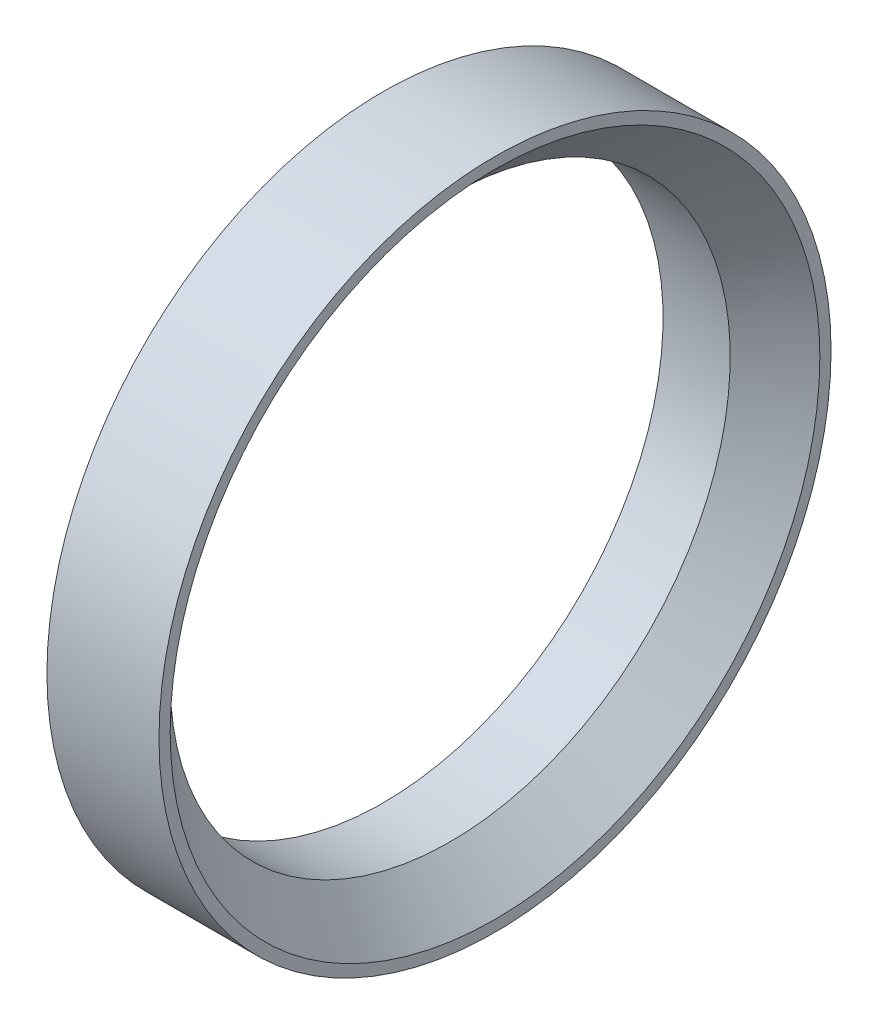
ISO-10303-21;
HEADER;
FILE_DESCRIPTION(('STEP AP214'),'2;1');
FILE_NAME('part.step','',(''),(''),'','','');
FILE_SCHEMA(('AUTOMOTIVE_DESIGN { 1 0 10303 214 1 1 1 1 }'));
ENDSEC;
DATA;
#1=APPLICATION_CONTEXT('core data for automotive mechanical design processes');
#2=APPLICATION_PROTOCOL_DEFINITION('international standard','automotive_design',2000,#1);
#3=PRODUCT_CONTEXT('',#1,'mechanical');
#4=PRODUCT('Part','Part','',(#3));
#5=PRODUCT_RELATED_PRODUCT_CATEGORY('part','',(#4));
#6=PRODUCT_DEFINITION_FORMATION('','',#4);
#7=PRODUCT_DEFINITION_CONTEXT('part definition',#1,'design');
#8=PRODUCT_DEFINITION('design','',#6,#7);
#9=PRODUCT_DEFINITION_SHAPE('','',#8);
#10=(LENGTH_UNIT() NAMED_UNIT(*) SI_UNIT(.MILLI.,.METRE.));
#11=(NAMED_UNIT(*) PLANE_ANGLE_UNIT() SI_UNIT($,.RADIAN.));
#12=(NAMED_UNIT(*) SI_UNIT($,.STERADIAN.) SOLID_ANGLE_UNIT());
#13=UNCERTAINTY_MEASURE_WITH_UNIT(LENGTH_MEASURE(1.E-05),#10,'distance_accuracy_value','');
#14=(GEOMETRIC_REPRESENTATION_CONTEXT(3) GLOBAL_UNCERTAINTY_ASSIGNED_CONTEXT((#13)) GLOBAL_UNIT_ASSIGNED_CONTEXT((#10,
#11,#12)) REPRESENTATION_CONTEXT('',''));
#15=CARTESIAN_POINT('',(0.,0.,0.));
#16=DIRECTION('',(0.,0.,1.));
#17=DIRECTION('',(1.,0.,0.));
#18=AXIS2_PLACEMENT_3D('',#15,#16,#17);
#19=CARTESIAN_POINT('',(4.14536842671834,3.,0.));
#20=DIRECTION('',(1.,0.,0.));
#21=DIRECTION('',(0.,0.,-1.));
#22=AXIS2_PLACEMENT_3D('',#19,#20,#21);
#23=PLANE('',#22);
#24=CARTESIAN_POINT('',(4.14536842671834,0.,0.));
#25=DIRECTION('',(-1.,0.,0.));
#26=DIRECTION('',(0.,0.,1.));
#27=AXIS2_PLACEMENT_3D('',#24,#25,#26);
#28=CIRCLE('',#27,2.5);
#29=CARTESIAN_POINT('',(4.14536842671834,0.,2.5));
#30=VERTEX_POINT('',#29);
#31=EDGE_CURVE('E34',#30,#30,#28,.T.);
#32=ORIENTED_EDGE('',*,*,#31,.F.);
#33=EDGE_LOOP('',(#32));
#34=FACE_BOUND('',#33,.T.);
#35=CARTESIAN_POINT('',(4.14536842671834,0.,0.));
#36=DIRECTION('',(-1.,0.,0.));
#37=DIRECTION('',(0.,0.,1.));
#38=AXIS2_PLACEMENT_3D('',#35,#36,#37);
#39=CIRCLE('',#38,3.);
#40=CARTESIAN_POINT('',(4.14536842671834,0.,3.));
#41=VERTEX_POINT('',#40);
#42=EDGE_CURVE('E43',#41,#41,#39,.T.);
#43=ORIENTED_EDGE('',*,*,#42,.T.);
#44=EDGE_LOOP('',(#43));
#45=FACE_BOUND('',#44,.T.);
#46=ADVANCED_FACE('F24',(#34,#45),#23,.F.);
#47=CARTESIAN_POINT('',(-14.7678750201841,0.,0.));
#48=DIRECTION('',(-1.,0.,0.));
#49=DIRECTION('',(0.,0.,1.));
#50=AXIS2_PLACEMENT_3D('',#47,#48,#49);
#51=CYLINDRICAL_SURFACE('',#50,2.5);
#52=CARTESIAN_POINT('',(4.74536842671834,0.,0.));
#53=DIRECTION('',(-1.,0.,0.));
#54=DIRECTION('',(0.,0.,1.));
#55=AXIS2_PLACEMENT_3D('',#52,#53,#54);
#56=CIRCLE('',#55,2.5);
#57=CARTESIAN_POINT('',(4.74536842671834,0.,2.5));
#58=VERTEX_POINT('',#57);
#59=EDGE_CURVE('E10',#58,#58,#56,.F.);
#60=ORIENTED_EDGE('',*,*,#59,.T.);
#61=EDGE_LOOP('',(#60));
#62=FACE_BOUND('',#61,.T.);
#63=ORIENTED_EDGE('',*,*,#31,.T.);
#64=EDGE_LOOP('',(#63));
#65=FACE_BOUND('',#64,.T.);
#66=ADVANCED_FACE('F57',(#62,#65),#51,.F.);
#67=CARTESIAN_POINT('',(5.14536842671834,3.,0.));
#68=DIRECTION('',(-1.,0.,0.));
#69=DIRECTION('',(0.,0.,1.));
#70=AXIS2_PLACEMENT_3D('',#67,#68,#69);
#71=PLANE('',#70);
#72=CARTESIAN_POINT('',(5.14536842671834,0.,0.));
#73=DIRECTION('',(-1.,0.,0.));
#74=DIRECTION('',(0.,0.,1.));
#75=AXIS2_PLACEMENT_3D('',#72,#73,#74);
#76=CIRCLE('',#75,2.9);
#77=CARTESIAN_POINT('',(5.14536842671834,0.,2.9));
#78=VERTEX_POINT('',#77);
#79=EDGE_CURVE('E30',#78,#78,#76,.T.);
#80=ORIENTED_EDGE('',*,*,#79,.T.);
#81=EDGE_LOOP('',(#80));
#82=FACE_BOUND('',#81,.T.);
#83=CARTESIAN_POINT('',(5.14536842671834,0.,0.));
#84=DIRECTION('',(-1.,0.,0.));
#85=DIRECTION('',(0.,0.,1.));
#86=AXIS2_PLACEMENT_3D('',#83,#84,#85);
#87=CIRCLE('',#86,3.);
#88=CARTESIAN_POINT('',(5.14536842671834,0.,3.));
#89=VERTEX_POINT('',#88);
#90=EDGE_CURVE('E38',#89,#89,#87,.T.);
#91=ORIENTED_EDGE('',*,*,#90,.F.);
#92=EDGE_LOOP('',(#91));
#93=FACE_BOUND('',#92,.T.);
#94=ADVANCED_FACE('F52',(#82,#93),#71,.F.);
#95=CARTESIAN_POINT('',(-14.7678750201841,0.,0.));
#96=DIRECTION('',(-1.,0.,0.));
#97=DIRECTION('',(0.,0.,1.));
#98=AXIS2_PLACEMENT_3D('',#95,#96,#97);
#99=CYLINDRICAL_SURFACE('',#98,3.);
#100=ORIENTED_EDGE('',*,*,#42,.F.);
#101=EDGE_LOOP('',(#100));
#102=FACE_BOUND('',#101,.T.);
#103=ORIENTED_EDGE('',*,*,#90,.T.);
#104=EDGE_LOOP('',(#103));
#105=FACE_BOUND('',#104,.T.);
#106=ADVANCED_FACE('F48',(#102,#105),#99,.T.);
#107=CARTESIAN_POINT('',(5.14536842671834,0.,0.));
#108=DIRECTION('',(1.,0.,0.));
#109=DIRECTION('',(0.,0.,-1.));
#110=AXIS2_PLACEMENT_3D('',#107,#108,#109);
#111=CONICAL_SURFACE('',#110,2.9,0.785398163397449);
#112=ORIENTED_EDGE('',*,*,#59,.F.);
#113=EDGE_LOOP('',(#112));
#114=FACE_BOUND('',#113,.T.);
#115=ORIENTED_EDGE('',*,*,#79,.F.);
#116=EDGE_LOOP('',(#115));
#117=FACE_BOUND('',#116,.T.);
#118=ADVANCED_FACE('F51',(#114,#117),#111,.F.);
#119=CLOSED_SHELL('',(#46,#66,#94,#106,#118));
#120=MANIFOLD_SOLID_BREP('B2',#119);
#121=ADVANCED_BREP_SHAPE_REPRESENTATION('',(#18,#120),#14);
#122=SHAPE_DEFINITION_REPRESENTATION(#9,#121);
ENDSEC;
END-ISO-10303-21;
